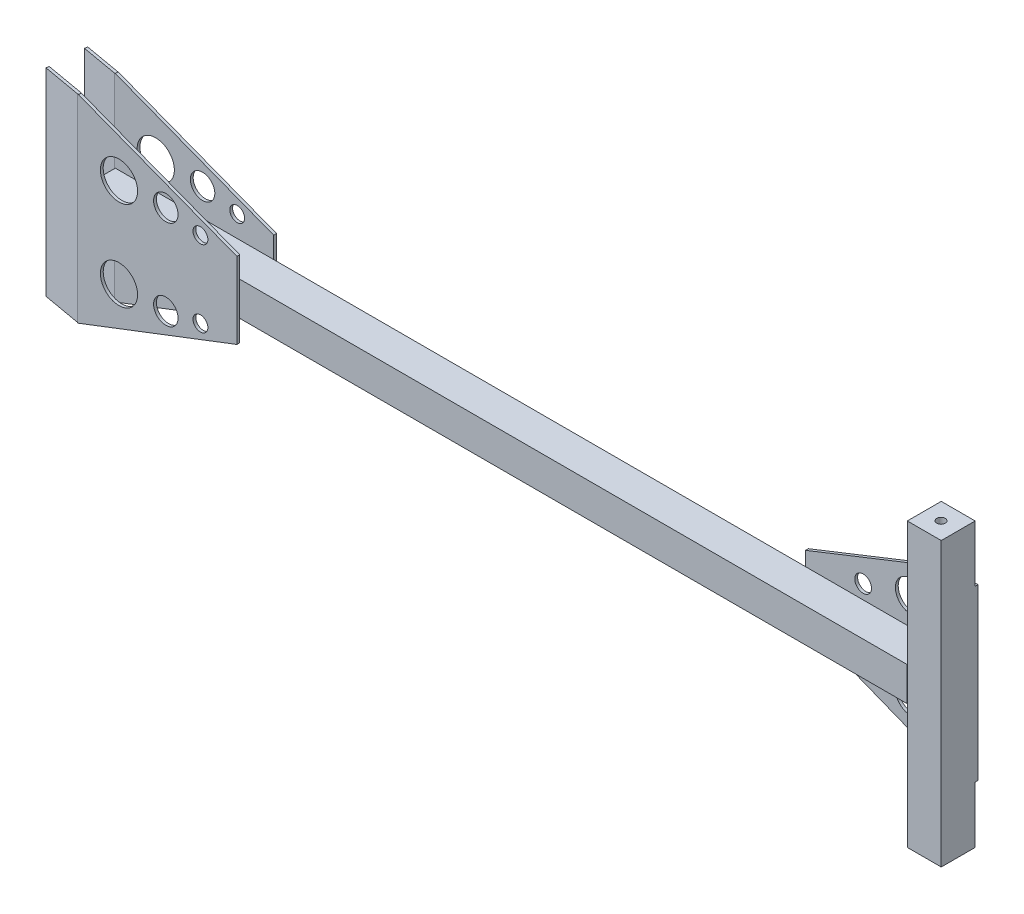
from build123d import *

# Parameters (mm, degrees)
ESQUISSE1_W                = 584
ESQUISSE1_H                = 24
EXTRUSION1_DEPTH           = 24
ESQUISSE2_R                = 5.258452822
ESQUISSE2_R_2              = 8.65585208
ESQUISSE2_R_3              = 13.164363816
EXTRUSION2_DEPTH           = 2
ESQUISSE3_W                = 24
ESQUISSE3_H                = 200
EXTRUSION3_DEPTH           = 24
ESQUISSE4_R                = 10.989123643
ESQUISSE4_R_2              = 5.917220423
EXTRUSION4_DEPTH           = 2
ESQUISSE6_W                = 28
ESQUISSE6_H                = 140
EXTRUSION6_DEPTH           = 2
ESQUISSE7_W                = 26
ESQUISSE7_H                = 140
EXTRUSION7_DEPTH           = 2
ESQUISSE8_R                = 3
EXTRUSION8_DEPTH           = 10
R_P_TITION_LIN_AIRE1_COUNT = 2
R_P_TITION_LIN_AIRE1_PITCH = 190


with BuildPart() as part:
    # Esquisse1 → Extrusion1 (new body)
    with BuildSketch(Plane.XY):
        with Locations((292, 12)):
            Rectangle(ESQUISSE1_W, ESQUISSE1_H)
    extrude(amount=EXTRUSION1_DEPTH)

    # Esquisse2 → Extrusion2 (add)
    with BuildSketch(Plane.XY.offset(24)):
        Polygon((0, -58), (112, -15), (112, 39), (0, 82), (-0.738409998, 82), (-0.738409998, -58), align=None)
        with Locations((86.20277416, 39)):
            Circle(ESQUISSE2_R, mode=Mode.SUBTRACT)
        with Locations((61.721017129, 43.720904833)):
            Circle(ESQUISSE2_R_2, mode=Mode.SUBTRACT)
        with Locations((28.594694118, 43.720904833)):
            Circle(ESQUISSE2_R_3, mode=Mode.SUBTRACT)
        with Locations(Location((86.20277416, -15, 0), (0, 0, 180))):
            Circle(ESQUISSE2_R, mode=Mode.SUBTRACT)
        with Locations(Location((61.721017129, -19.720904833, 0), (0, 0, 180))):
            Circle(ESQUISSE2_R_2, mode=Mode.SUBTRACT)
        with Locations(Location((28.594694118, -19.720904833, 0), (0, 0, 180))):
            Circle(ESQUISSE2_R_3, mode=Mode.SUBTRACT)
    extrusion2 = extrude(amount=EXTRUSION2_DEPTH)

    # Sym_trie1: Extrusion2 across plane
    add(extrusion2.mirror(Plane.XY.offset(12)))



with BuildPart() as body_2:
    # Esquisse3 → Extrusion3 (new body)
    with BuildSketch(Plane.XY.offset(24)):
        with Locations((596.185893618, 12)):
            Rectangle(ESQUISSE3_W, ESQUISSE3_H)
    extrude(amount=-EXTRUSION3_DEPTH)


with BuildPart() as part_1:
    add(part.part)

    add(body_2.part)  # Extrusion4 merges body 2
    # Esquisse4 → Extrusion4 (add)
    with BuildSketch(Plane(origin=(0, 0, 0), x_dir=(-1, 0, 0), z_dir=(0, 0, -1))):
        Polygon((-608.185893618, 72), (-584.185893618, 72), (-488.185893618, 34), (-488.185893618, -10), (-584.185893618, -48), (-608.185893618, -48), align=None)
        with Locations((-562.742624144, 43.09214165)):
            Circle(ESQUISSE4_R, mode=Mode.SUBTRACT)
        with Locations((-528.929936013, 34)):
            Circle(ESQUISSE4_R_2, mode=Mode.SUBTRACT)
        with Locations(Location((-528.929936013, -10, 0), (0, 0, 180))):
            Circle(ESQUISSE4_R_2, mode=Mode.SUBTRACT)
        with Locations(Location((-562.742624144, -19.09214165, 0), (0, 0, 180))):
            Circle(ESQUISSE4_R, mode=Mode.SUBTRACT)
    extrude(amount=EXTRUSION4_DEPTH)

    # Esquisse6 → Extrusion6 (add)
    with BuildSketch(Plane(origin=(-4.10424172, 0, 23.276311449), x_dir=(-0.9848077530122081, 0, -0.17364817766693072), z_dir=(0.17364817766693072, 0, -0.9848077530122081))):
        with Locations((9.828564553, 12.05542203)):
            Rectangle(ESQUISSE6_W, ESQUISSE6_H)
    extrude(amount=-EXTRUSION6_DEPTH)

    # Esquisse7 → Extrusion7 (add)
    with BuildSketch(Plane(origin=(-0.022265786, 0, 0.126275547), x_dir=(0.9848077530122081, 0, 0.17364817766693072), z_dir=(-0.17364817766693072, 0, 0.9848077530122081))):
        with Locations((-13.727191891, 12)):
            Rectangle(ESQUISSE7_W, ESQUISSE7_H)
    extrude(amount=-EXTRUSION7_DEPTH)

    # Esquisse8 → Extrusion8 (cut)
    with BuildSketch(Plane(origin=(0, 112, 0), x_dir=(1, 0, 0), z_dir=(0, 1, 0))):
        with Locations(Location((596.014446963, -12, 0), (0, 0, 270))):
            Circle(ESQUISSE8_R)
    extrusion8 = extrude(amount=-EXTRUSION8_DEPTH, mode=Mode.SUBTRACT)

    # R_p_tition lin_aire1: Extrusion8 ×2
    with Locations(*[(0, -i * R_P_TITION_LIN_AIRE1_PITCH, 0) for i in range(1, R_P_TITION_LIN_AIRE1_COUNT)]):
        add(extrusion8, mode=Mode.SUBTRACT)


solid = part_1.part
